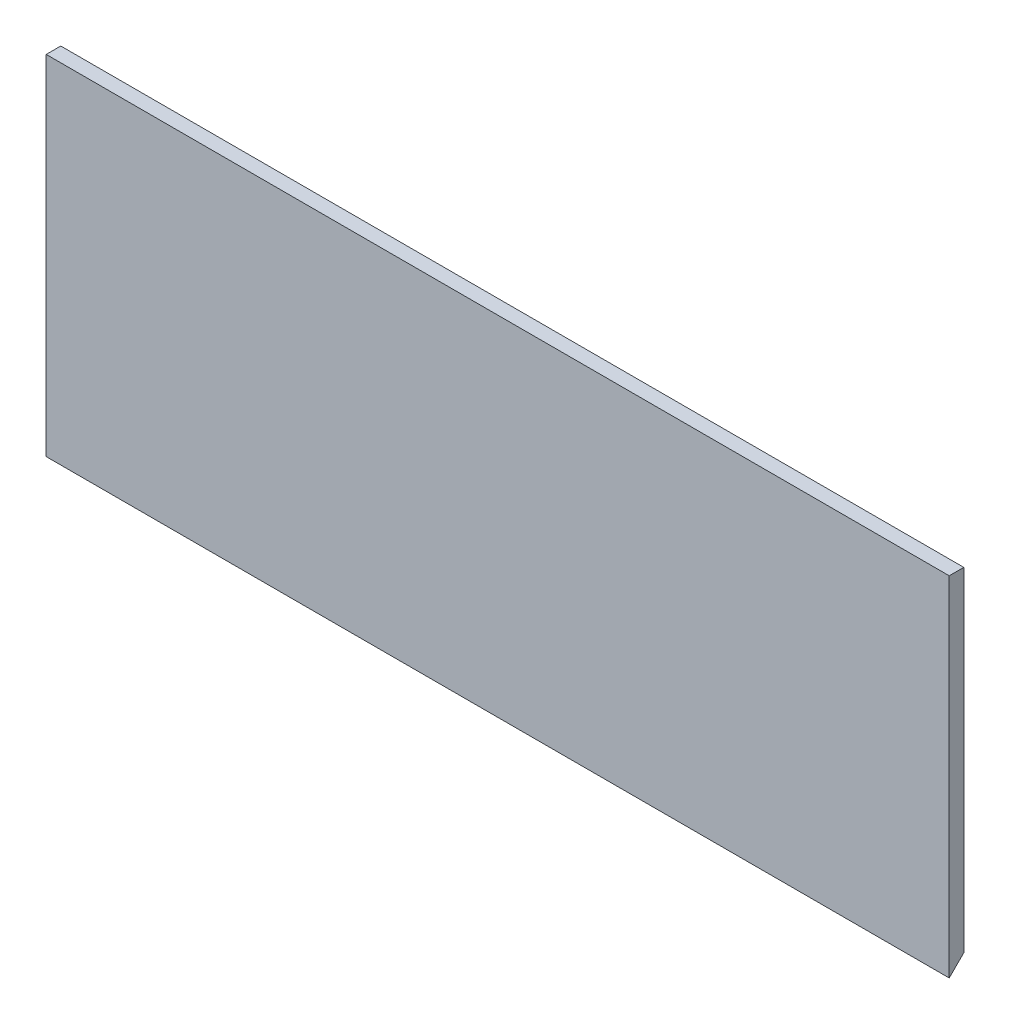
ISO-10303-21;
HEADER;
FILE_DESCRIPTION(('STEP AP214'),'2;1');
FILE_NAME('part.step','',(''),(''),'','','');
FILE_SCHEMA(('AUTOMOTIVE_DESIGN { 1 0 10303 214 1 1 1 1 }'));
ENDSEC;
DATA;
#1=APPLICATION_CONTEXT('core data for automotive mechanical design processes');
#2=APPLICATION_PROTOCOL_DEFINITION('international standard','automotive_design',2000,#1);
#3=PRODUCT_CONTEXT('',#1,'mechanical');
#4=PRODUCT('Part','Part','',(#3));
#5=PRODUCT_RELATED_PRODUCT_CATEGORY('part','',(#4));
#6=PRODUCT_DEFINITION_FORMATION('','',#4);
#7=PRODUCT_DEFINITION_CONTEXT('part definition',#1,'design');
#8=PRODUCT_DEFINITION('design','',#6,#7);
#9=PRODUCT_DEFINITION_SHAPE('','',#8);
#10=(LENGTH_UNIT() NAMED_UNIT(*) SI_UNIT(.MILLI.,.METRE.));
#11=(NAMED_UNIT(*) PLANE_ANGLE_UNIT() SI_UNIT($,.RADIAN.));
#12=(NAMED_UNIT(*) SI_UNIT($,.STERADIAN.) SOLID_ANGLE_UNIT());
#13=UNCERTAINTY_MEASURE_WITH_UNIT(LENGTH_MEASURE(1.E-05),#10,'distance_accuracy_value','');
#14=(GEOMETRIC_REPRESENTATION_CONTEXT(3) GLOBAL_UNCERTAINTY_ASSIGNED_CONTEXT((#13)) GLOBAL_UNIT_ASSIGNED_CONTEXT((#10,
#11,#12)) REPRESENTATION_CONTEXT('',''));
#15=CARTESIAN_POINT('',(0.,0.,0.));
#16=DIRECTION('',(0.,0.,1.));
#17=DIRECTION('',(1.,0.,0.));
#18=AXIS2_PLACEMENT_3D('',#15,#16,#17);
#19=CARTESIAN_POINT('',(590.55,-227.80625,9.525));
#20=DIRECTION('',(-1.,0.,0.));
#21=DIRECTION('',(0.,0.,1.));
#22=AXIS2_PLACEMENT_3D('',#19,#20,#21);
#23=PLANE('',#22);
#24=DIRECTION('',(0.,0.707106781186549,-0.707106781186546));
#25=VECTOR('',#24,1.);
#26=CARTESIAN_POINT('',(590.55,68.2765825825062,-286.557832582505));
#27=LINE('',#26,#25);
#28=CARTESIAN_POINT('',(590.55,-227.80625,9.52500000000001));
#29=VERTEX_POINT('',#28);
#30=CARTESIAN_POINT('',(590.55,-208.75625,-9.52499999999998));
#31=VERTEX_POINT('',#30);
#32=EDGE_CURVE('E93',#29,#31,#27,.T.);
#33=ORIENTED_EDGE('',*,*,#32,.T.);
#34=DIRECTION('',(0.,1.,0.));
#35=VECTOR('',#34,1.);
#36=CARTESIAN_POINT('',(590.55,-227.80625,-9.525));
#37=LINE('',#36,#35);
#38=CARTESIAN_POINT('',(590.55,227.80625,-9.525));
#39=VERTEX_POINT('',#38);
#40=EDGE_CURVE('E74',#31,#39,#37,.T.);
#41=ORIENTED_EDGE('',*,*,#40,.T.);
#42=DIRECTION('',(0.,0.,-1.));
#43=VECTOR('',#42,1.);
#44=CARTESIAN_POINT('',(590.55,227.80625,9.525));
#45=LINE('',#44,#43);
#46=CARTESIAN_POINT('',(590.55,227.80625,9.525));
#47=VERTEX_POINT('',#46);
#48=EDGE_CURVE('E11',#47,#39,#45,.T.);
#49=ORIENTED_EDGE('',*,*,#48,.F.);
#50=DIRECTION('',(0.,1.,0.));
#51=VECTOR('',#50,1.);
#52=CARTESIAN_POINT('',(590.55,-227.80625,9.525));
#53=LINE('',#52,#51);
#54=EDGE_CURVE('E83',#29,#47,#53,.T.);
#55=ORIENTED_EDGE('',*,*,#54,.F.);
#56=EDGE_LOOP('',(#33,#41,#49,#55));
#57=FACE_BOUND('',#56,.T.);
#58=ADVANCED_FACE('F30',(#57),#23,.F.);
#59=CARTESIAN_POINT('',(-590.55,-227.80625,9.525));
#60=DIRECTION('',(1.,0.,0.));
#61=DIRECTION('',(0.,0.,-1.));
#62=AXIS2_PLACEMENT_3D('',#59,#60,#61);
#63=PLANE('',#62);
#64=DIRECTION('',(0.,0.707106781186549,-0.707106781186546));
#65=VECTOR('',#64,1.);
#66=CARTESIAN_POINT('',(-590.55,68.2765825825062,-286.557832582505));
#67=LINE('',#66,#65);
#68=CARTESIAN_POINT('',(-590.55,-227.80625,9.52500000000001));
#69=VERTEX_POINT('',#68);
#70=CARTESIAN_POINT('',(-590.55,-208.75625,-9.525));
#71=VERTEX_POINT('',#70);
#72=EDGE_CURVE('E44',#69,#71,#67,.T.);
#73=ORIENTED_EDGE('',*,*,#72,.F.);
#74=DIRECTION('',(0.,-1.,0.));
#75=VECTOR('',#74,1.);
#76=CARTESIAN_POINT('',(-590.55,-227.80625,9.525));
#77=LINE('',#76,#75);
#78=CARTESIAN_POINT('',(-590.55,227.80625,9.525));
#79=VERTEX_POINT('',#78);
#80=EDGE_CURVE('E79',#79,#69,#77,.T.);
#81=ORIENTED_EDGE('',*,*,#80,.F.);
#82=DIRECTION('',(0.,0.,-1.));
#83=VECTOR('',#82,1.);
#84=CARTESIAN_POINT('',(-590.55,227.80625,9.525));
#85=LINE('',#84,#83);
#86=CARTESIAN_POINT('',(-590.55,227.80625,-9.525));
#87=VERTEX_POINT('',#86);
#88=EDGE_CURVE('E37',#79,#87,#85,.T.);
#89=ORIENTED_EDGE('',*,*,#88,.T.);
#90=DIRECTION('',(0.,-1.,0.));
#91=VECTOR('',#90,1.);
#92=CARTESIAN_POINT('',(-590.55,-227.80625,-9.525));
#93=LINE('',#92,#91);
#94=EDGE_CURVE('E73',#87,#71,#93,.T.);
#95=ORIENTED_EDGE('',*,*,#94,.T.);
#96=EDGE_LOOP('',(#73,#81,#89,#95));
#97=FACE_BOUND('',#96,.T.);
#98=ADVANCED_FACE('F78',(#97),#63,.F.);
#99=CARTESIAN_POINT('',(590.55,227.80625,-9.525));
#100=DIRECTION('',(0.,0.,-1.));
#101=DIRECTION('',(-1.,0.,0.));
#102=AXIS2_PLACEMENT_3D('',#99,#100,#101);
#103=PLANE('',#102);
#104=ORIENTED_EDGE('',*,*,#40,.F.);
#105=DIRECTION('',(1.,0.,0.));
#106=VECTOR('',#105,1.);
#107=CARTESIAN_POINT('',(-590.55,-208.75625,-9.52499999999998));
#108=LINE('',#107,#106);
#109=EDGE_CURVE('E82',#71,#31,#108,.T.);
#110=ORIENTED_EDGE('',*,*,#109,.F.);
#111=ORIENTED_EDGE('',*,*,#94,.F.);
#112=DIRECTION('',(-1.,0.,0.));
#113=VECTOR('',#112,1.);
#114=CARTESIAN_POINT('',(-590.55,227.80625,-9.525));
#115=LINE('',#114,#113);
#116=EDGE_CURVE('E65',#39,#87,#115,.T.);
#117=ORIENTED_EDGE('',*,*,#116,.F.);
#118=EDGE_LOOP('',(#104,#110,#111,#117));
#119=FACE_BOUND('',#118,.T.);
#120=ADVANCED_FACE('F81',(#119),#103,.T.);
#121=CARTESIAN_POINT('',(-590.55,227.80625,9.525));
#122=DIRECTION('',(0.,-1.,0.));
#123=DIRECTION('',(0.,0.,-1.));
#124=AXIS2_PLACEMENT_3D('',#121,#122,#123);
#125=PLANE('',#124);
#126=ORIENTED_EDGE('',*,*,#116,.T.);
#127=ORIENTED_EDGE('',*,*,#88,.F.);
#128=DIRECTION('',(-1.,0.,0.));
#129=VECTOR('',#128,1.);
#130=CARTESIAN_POINT('',(-590.55,227.80625,9.525));
#131=LINE('',#130,#129);
#132=EDGE_CURVE('E53',#47,#79,#131,.T.);
#133=ORIENTED_EDGE('',*,*,#132,.F.);
#134=ORIENTED_EDGE('',*,*,#48,.T.);
#135=EDGE_LOOP('',(#126,#127,#133,#134));
#136=FACE_BOUND('',#135,.T.);
#137=ADVANCED_FACE('F67',(#136),#125,.F.);
#138=CARTESIAN_POINT('',(590.55,227.80625,9.525));
#139=DIRECTION('',(0.,0.,-1.));
#140=DIRECTION('',(-1.,0.,0.));
#141=AXIS2_PLACEMENT_3D('',#138,#139,#140);
#142=PLANE('',#141);
#143=ORIENTED_EDGE('',*,*,#54,.T.);
#144=ORIENTED_EDGE('',*,*,#132,.T.);
#145=ORIENTED_EDGE('',*,*,#80,.T.);
#146=DIRECTION('',(1.,0.,0.));
#147=VECTOR('',#146,1.);
#148=CARTESIAN_POINT('',(-590.55,-227.80625,9.525));
#149=LINE('',#148,#147);
#150=EDGE_CURVE('E80',#69,#29,#149,.T.);
#151=ORIENTED_EDGE('',*,*,#150,.T.);
#152=EDGE_LOOP('',(#143,#144,#145,#151));
#153=FACE_BOUND('',#152,.T.);
#154=ADVANCED_FACE('F103',(#153),#142,.F.);
#155=CARTESIAN_POINT('',(-590.55,68.2765825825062,-286.557832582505));
#156=DIRECTION('',(0.,-0.707106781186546,-0.707106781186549));
#157=DIRECTION('',(0.,0.707106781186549,-0.707106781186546));
#158=AXIS2_PLACEMENT_3D('',#155,#156,#157);
#159=PLANE('',#158);
#160=ORIENTED_EDGE('',*,*,#32,.F.);
#161=ORIENTED_EDGE('',*,*,#150,.F.);
#162=ORIENTED_EDGE('',*,*,#72,.T.);
#163=ORIENTED_EDGE('',*,*,#109,.T.);
#164=EDGE_LOOP('',(#160,#161,#162,#163));
#165=FACE_BOUND('',#164,.T.);
#166=ADVANCED_FACE('F101',(#165),#159,.T.);
#167=CLOSED_SHELL('',(#58,#98,#120,#137,#154,#166));
#168=MANIFOLD_SOLID_BREP('B2',#167);
#169=ADVANCED_BREP_SHAPE_REPRESENTATION('',(#18,#168),#14);
#170=SHAPE_DEFINITION_REPRESENTATION(#9,#169);
ENDSEC;
END-ISO-10303-21;
